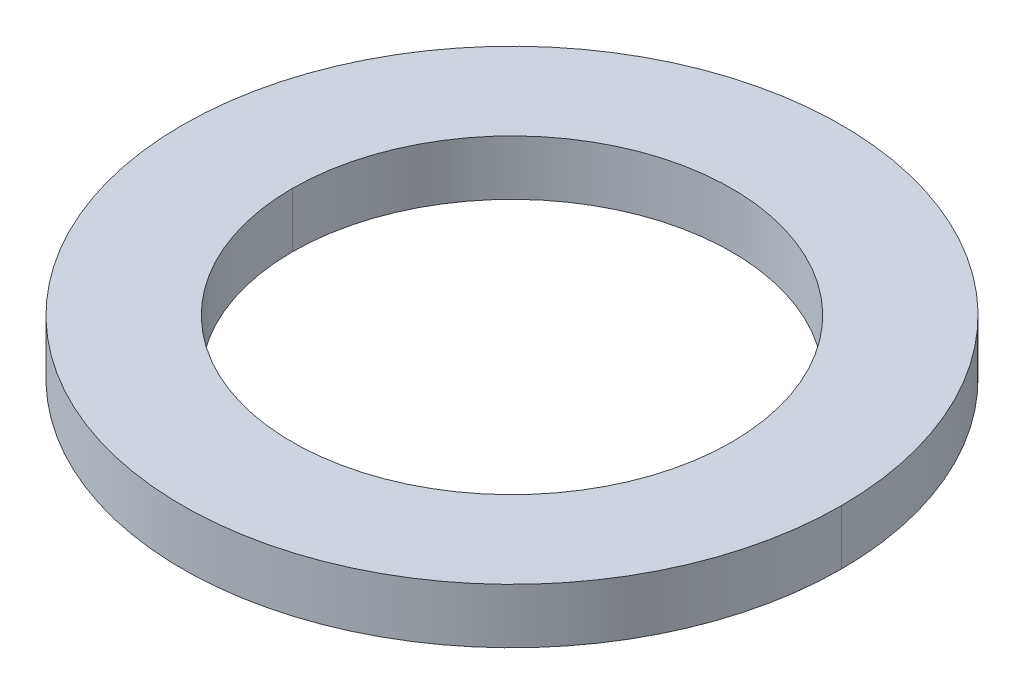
ISO-10303-21;
HEADER;
FILE_DESCRIPTION(('STEP AP214'),'2;1');
FILE_NAME('part.step','',(''),(''),'','','');
FILE_SCHEMA(('AUTOMOTIVE_DESIGN { 1 0 10303 214 1 1 1 1 }'));
ENDSEC;
DATA;
#1=APPLICATION_CONTEXT('core data for automotive mechanical design processes');
#2=APPLICATION_PROTOCOL_DEFINITION('international standard','automotive_design',2000,#1);
#3=PRODUCT_CONTEXT('',#1,'mechanical');
#4=PRODUCT('Part','Part','',(#3));
#5=PRODUCT_RELATED_PRODUCT_CATEGORY('part','',(#4));
#6=PRODUCT_DEFINITION_FORMATION('','',#4);
#7=PRODUCT_DEFINITION_CONTEXT('part definition',#1,'design');
#8=PRODUCT_DEFINITION('design','',#6,#7);
#9=PRODUCT_DEFINITION_SHAPE('','',#8);
#10=(LENGTH_UNIT() NAMED_UNIT(*) SI_UNIT(.MILLI.,.METRE.));
#11=(NAMED_UNIT(*) PLANE_ANGLE_UNIT() SI_UNIT($,.RADIAN.));
#12=(NAMED_UNIT(*) SI_UNIT($,.STERADIAN.) SOLID_ANGLE_UNIT());
#13=UNCERTAINTY_MEASURE_WITH_UNIT(LENGTH_MEASURE(1.E-05),#10,'distance_accuracy_value','');
#14=(GEOMETRIC_REPRESENTATION_CONTEXT(3) GLOBAL_UNCERTAINTY_ASSIGNED_CONTEXT((#13)) GLOBAL_UNIT_ASSIGNED_CONTEXT((#10,
#11,#12)) REPRESENTATION_CONTEXT('',''));
#15=CARTESIAN_POINT('',(0.,0.,0.));
#16=DIRECTION('',(0.,0.,1.));
#17=DIRECTION('',(1.,0.,0.));
#18=AXIS2_PLACEMENT_3D('',#15,#16,#17);
#19=CARTESIAN_POINT('',(0.,1.5875,0.));
#20=DIRECTION('',(0.,1.,0.));
#21=DIRECTION('',(0.,0.,1.));
#22=AXIS2_PLACEMENT_3D('',#19,#20,#21);
#23=PLANE('',#22);
#24=CARTESIAN_POINT('',(0.,1.5875,0.));
#25=DIRECTION('',(0.,-1.,0.));
#26=DIRECTION('',(0.,0.,-1.));
#27=AXIS2_PLACEMENT_3D('',#24,#25,#26);
#28=CIRCLE('',#27,19.05);
#29=CARTESIAN_POINT('',(19.05,1.5875,0.));
#30=VERTEX_POINT('',#29);
#31=CARTESIAN_POINT('',(-19.05,1.5875,0.));
#32=VERTEX_POINT('',#31);
#33=EDGE_CURVE('E73',#30,#32,#28,.T.);
#34=ORIENTED_EDGE('',*,*,#33,.F.);
#35=CARTESIAN_POINT('',(0.,1.5875,0.));
#36=DIRECTION('',(0.,-1.,0.));
#37=DIRECTION('',(0.,0.,-1.));
#38=AXIS2_PLACEMENT_3D('',#35,#36,#37);
#39=CIRCLE('',#38,19.05);
#40=EDGE_CURVE('E69',#32,#30,#39,.T.);
#41=ORIENTED_EDGE('',*,*,#40,.F.);
#42=EDGE_LOOP('',(#34,#41));
#43=FACE_BOUND('',#42,.T.);
#44=CARTESIAN_POINT('',(0.,1.5875,0.));
#45=DIRECTION('',(0.,-1.,0.));
#46=DIRECTION('',(0.,0.,-1.));
#47=AXIS2_PLACEMENT_3D('',#44,#45,#46);
#48=CIRCLE('',#47,12.7);
#49=CARTESIAN_POINT('',(-12.7,1.5875,0.));
#50=VERTEX_POINT('',#49);
#51=CARTESIAN_POINT('',(12.7,1.5875,0.));
#52=VERTEX_POINT('',#51);
#53=EDGE_CURVE('E53',#50,#52,#48,.T.);
#54=ORIENTED_EDGE('',*,*,#53,.T.);
#55=CARTESIAN_POINT('',(0.,1.5875,0.));
#56=DIRECTION('',(0.,-1.,0.));
#57=DIRECTION('',(0.,0.,-1.));
#58=AXIS2_PLACEMENT_3D('',#55,#56,#57);
#59=CIRCLE('',#58,12.7);
#60=EDGE_CURVE('E19',#52,#50,#59,.T.);
#61=ORIENTED_EDGE('',*,*,#60,.T.);
#62=EDGE_LOOP('',(#54,#61));
#63=FACE_BOUND('',#62,.T.);
#64=ADVANCED_FACE('F16',(#43,#63),#23,.T.);
#65=CARTESIAN_POINT('',(0.,0.,0.));
#66=DIRECTION('',(0.,-1.,0.));
#67=DIRECTION('',(0.,0.,-1.));
#68=AXIS2_PLACEMENT_3D('',#65,#66,#67);
#69=CYLINDRICAL_SURFACE('',#68,12.7);
#70=CARTESIAN_POINT('',(0.,-1.5875,0.));
#71=DIRECTION('',(0.,-1.,0.));
#72=DIRECTION('',(0.,0.,-1.));
#73=AXIS2_PLACEMENT_3D('',#70,#71,#72);
#74=CIRCLE('',#73,12.7);
#75=CARTESIAN_POINT('',(-12.7,-1.5875,0.));
#76=VERTEX_POINT('',#75);
#77=CARTESIAN_POINT('',(12.7,-1.5875,0.));
#78=VERTEX_POINT('',#77);
#79=EDGE_CURVE('E62',#76,#78,#74,.F.);
#80=ORIENTED_EDGE('',*,*,#79,.F.);
#81=DIRECTION('',(0.,-1.,0.));
#82=VECTOR('',#81,1.);
#83=CARTESIAN_POINT('',(-12.7,0.,0.));
#84=LINE('',#83,#82);
#85=EDGE_CURVE('E58',#76,#50,#84,.F.);
#86=ORIENTED_EDGE('',*,*,#85,.T.);
#87=ORIENTED_EDGE('',*,*,#60,.F.);
#88=DIRECTION('',(0.,-1.,0.));
#89=VECTOR('',#88,1.);
#90=CARTESIAN_POINT('',(12.7,0.,0.));
#91=LINE('',#90,#89);
#92=EDGE_CURVE('E68',#52,#78,#91,.T.);
#93=ORIENTED_EDGE('',*,*,#92,.T.);
#94=EDGE_LOOP('',(#80,#86,#87,#93));
#95=FACE_BOUND('',#94,.T.);
#96=ADVANCED_FACE('F60',(#95),#69,.F.);
#97=CARTESIAN_POINT('',(0.,0.,0.));
#98=DIRECTION('',(0.,-1.,0.));
#99=DIRECTION('',(0.,0.,-1.));
#100=AXIS2_PLACEMENT_3D('',#97,#98,#99);
#101=CYLINDRICAL_SURFACE('',#100,12.7);
#102=ORIENTED_EDGE('',*,*,#53,.F.);
#103=ORIENTED_EDGE('',*,*,#85,.F.);
#104=CARTESIAN_POINT('',(0.,-1.5875,0.));
#105=DIRECTION('',(0.,-1.,0.));
#106=DIRECTION('',(0.,0.,-1.));
#107=AXIS2_PLACEMENT_3D('',#104,#105,#106);
#108=CIRCLE('',#107,12.7);
#109=EDGE_CURVE('E78',#78,#76,#108,.F.);
#110=ORIENTED_EDGE('',*,*,#109,.F.);
#111=ORIENTED_EDGE('',*,*,#92,.F.);
#112=EDGE_LOOP('',(#102,#103,#110,#111));
#113=FACE_BOUND('',#112,.T.);
#114=ADVANCED_FACE('F67',(#113),#101,.F.);
#115=CARTESIAN_POINT('',(0.,0.,0.));
#116=DIRECTION('',(0.,-1.,0.));
#117=DIRECTION('',(0.,0.,-1.));
#118=AXIS2_PLACEMENT_3D('',#115,#116,#117);
#119=CYLINDRICAL_SURFACE('',#118,19.05);
#120=DIRECTION('',(0.,-1.,0.));
#121=VECTOR('',#120,1.);
#122=CARTESIAN_POINT('',(-19.05,0.,0.));
#123=LINE('',#122,#121);
#124=CARTESIAN_POINT('',(-19.05,-1.5875,0.));
#125=VERTEX_POINT('',#124);
#126=EDGE_CURVE('E76',#32,#125,#123,.T.);
#127=ORIENTED_EDGE('',*,*,#126,.F.);
#128=ORIENTED_EDGE('',*,*,#40,.T.);
#129=DIRECTION('',(0.,-1.,0.));
#130=VECTOR('',#129,1.);
#131=CARTESIAN_POINT('',(19.05,0.,0.));
#132=LINE('',#131,#130);
#133=CARTESIAN_POINT('',(19.05,-1.5875,0.));
#134=VERTEX_POINT('',#133);
#135=EDGE_CURVE('E34',#134,#30,#132,.F.);
#136=ORIENTED_EDGE('',*,*,#135,.F.);
#137=CARTESIAN_POINT('',(0.,-1.5875,0.));
#138=DIRECTION('',(0.,-1.,0.));
#139=DIRECTION('',(0.,0.,-1.));
#140=AXIS2_PLACEMENT_3D('',#137,#138,#139);
#141=CIRCLE('',#140,19.05);
#142=EDGE_CURVE('E25',#125,#134,#141,.T.);
#143=ORIENTED_EDGE('',*,*,#142,.F.);
#144=EDGE_LOOP('',(#127,#128,#136,#143));
#145=FACE_BOUND('',#144,.T.);
#146=ADVANCED_FACE('F91',(#145),#119,.T.);
#147=CARTESIAN_POINT('',(0.,0.,0.));
#148=DIRECTION('',(0.,-1.,0.));
#149=DIRECTION('',(0.,0.,-1.));
#150=AXIS2_PLACEMENT_3D('',#147,#148,#149);
#151=CYLINDRICAL_SURFACE('',#150,19.05);
#152=ORIENTED_EDGE('',*,*,#126,.T.);
#153=CARTESIAN_POINT('',(0.,-1.5875,0.));
#154=DIRECTION('',(0.,-1.,0.));
#155=DIRECTION('',(0.,0.,-1.));
#156=AXIS2_PLACEMENT_3D('',#153,#154,#155);
#157=CIRCLE('',#156,19.05);
#158=EDGE_CURVE('E11',#134,#125,#157,.T.);
#159=ORIENTED_EDGE('',*,*,#158,.F.);
#160=ORIENTED_EDGE('',*,*,#135,.T.);
#161=ORIENTED_EDGE('',*,*,#33,.T.);
#162=EDGE_LOOP('',(#152,#159,#160,#161));
#163=FACE_BOUND('',#162,.T.);
#164=ADVANCED_FACE('F86',(#163),#151,.T.);
#165=CARTESIAN_POINT('',(0.,-1.5875,0.));
#166=DIRECTION('',(0.,-1.,0.));
#167=DIRECTION('',(0.,0.,-1.));
#168=AXIS2_PLACEMENT_3D('',#165,#166,#167);
#169=PLANE('',#168);
#170=ORIENTED_EDGE('',*,*,#142,.T.);
#171=ORIENTED_EDGE('',*,*,#158,.T.);
#172=EDGE_LOOP('',(#170,#171));
#173=FACE_BOUND('',#172,.T.);
#174=ORIENTED_EDGE('',*,*,#79,.T.);
#175=ORIENTED_EDGE('',*,*,#109,.T.);
#176=EDGE_LOOP('',(#174,#175));
#177=FACE_BOUND('',#176,.T.);
#178=ADVANCED_FACE('F89',(#173,#177),#169,.T.);
#179=CLOSED_SHELL('',(#64,#96,#114,#146,#164,#178));
#180=MANIFOLD_SOLID_BREP('B1',#179);
#181=ADVANCED_BREP_SHAPE_REPRESENTATION('',(#18,#180),#14);
#182=SHAPE_DEFINITION_REPRESENTATION(#9,#181);
ENDSEC;
END-ISO-10303-21;
